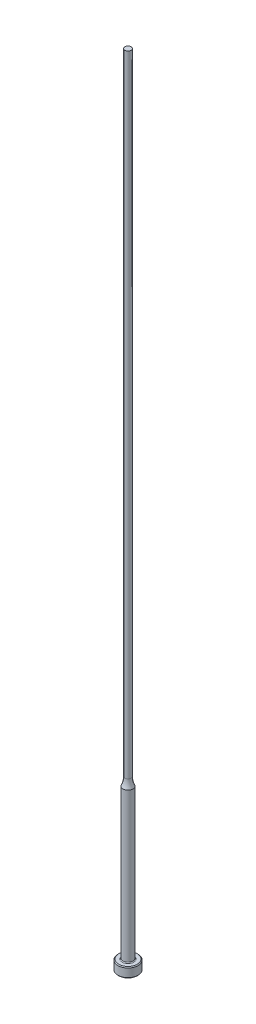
from build123d import *

# Parameters (mm, degrees)
CHAMFER1_SIZE = 0.254
FILLET1_R     = 0.254


with BuildPart() as part:
    # Sketch1 → Revolve1 (revolve)
    with BuildSketch(Plane.XY, mode=Mode.PRIVATE) as revolve1_sk:
        with BuildLine():
            Line((0, 0), (-3.175, 0))
            Line((-3.175, 0), (-3.175, 3.175))
            Line((-3.175, 3.175), (-1.5875, 3.175))
            Line((-1.5875, 3.175), (-1.5875, 50.8))
            ThreePointArc((-1.5875, 50.8), (-1.142565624, 52.109911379), (-0.99187, 53.485093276))
            Line((-0.99187, 53.485093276), (-0.99187, 254))
            Line((-0.99187, 254), (0, 254))
            Line((0, 254), (0, 0))
        make_face()
    revolve(revolve1_sk.sketch.rotate(Axis((0, 259.958771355, 0), (0, -1, 0)), 270), axis=Axis((0, 259.958771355, 0), (0, -1, 0)))

    # Chamfer1
    chamfer1_edges = [part.edges().sort_by_distance(p)[0] for p in [
        (0, 0, -3.175),
        (0, 3.175, -3.175),
    ]]
    chamfer(chamfer1_edges, length=CHAMFER1_SIZE)

    # Fillet1
    fillet1_edges = [part.edges().sort_by_distance(p)[0] for p in [
        (0, 3.175, -1.5875),
    ]]
    fillet(fillet1_edges, radius=FILLET1_R)


solid = part.part
